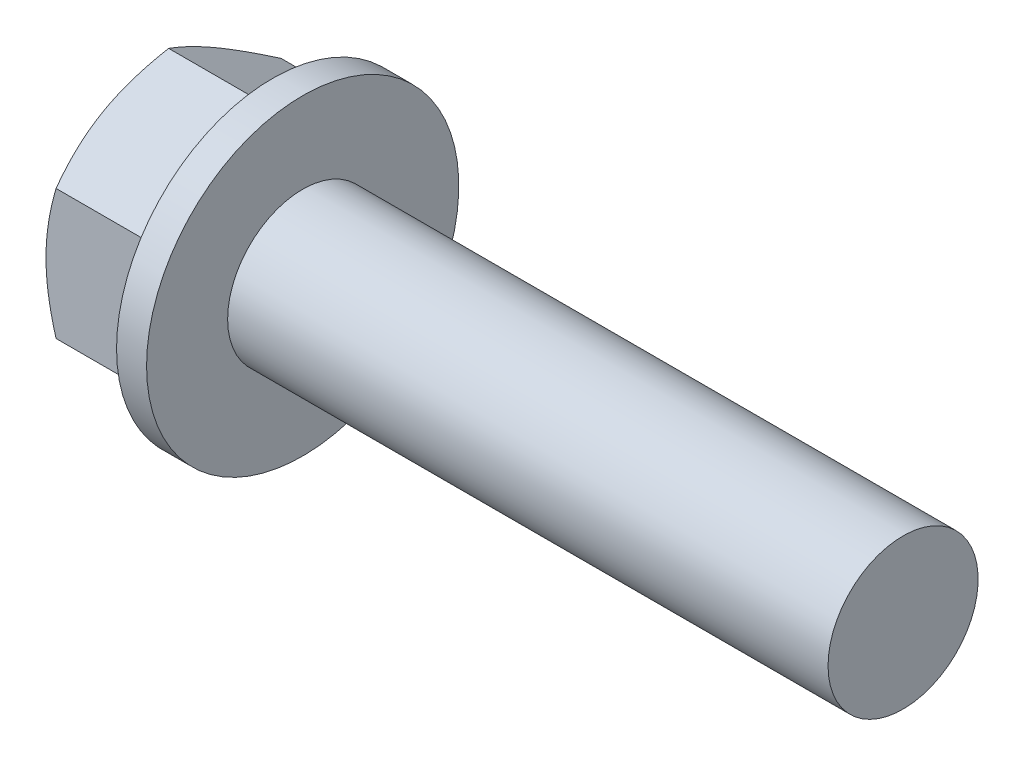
from build123d import *

# Parameters (mm, degrees)
SKETCH2_R     = 6.67004
HEX_DIE_DEPTH = 4.826
SKETCH4_R     = 4.1671875
INDENT_DEPTH  = 0.60325


with BuildPart() as part:
    # BodySke → Base-Revolve (revolve)
    with BuildSketch(Plane.XY, mode=Mode.PRIVATE) as base_revolve_sk:
        Polygon((6.096, 3.175), (6.096, 6.604), (4.826, 6.604), (4.826, 5.499422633), (0.42546248, 5.499422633), (0, 4.7625), (0, 0), (31.496, 0), (31.496, 3.175), align=None)
    revolve(base_revolve_sk.sketch.rotate(Axis((-25.4, 0, 0), (1, 0, 0)), 90), axis=Axis((-25.4, 0, 0), (1, 0, 0)))

    # Sketch2 → Hex-Die (cut)
    with BuildSketch(Plane(origin=(0, 0, 0), x_dir=(0, 0, -1), z_dir=(1, 0, 0))):
        Circle(SKETCH2_R)
        Polygon((-4.7625, 2.749630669), (0, 5.499261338), (4.7625, 2.749630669), (4.7625, -2.749630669), (0, -5.499261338), (-4.7625, -2.749630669), align=None, mode=Mode.SUBTRACT)
    extrude(amount=HEX_DIE_DEPTH, mode=Mode.SUBTRACT)

    # Sketch4 → Indent (cut)
    with BuildSketch(Plane(origin=(0, 0, 0), x_dir=(0, 0, -1), z_dir=(1, 0, 0))):
        with Locations(Location((0, 0, 0), (0, 0, 180))):
            Circle(SKETCH4_R)
    extrude(amount=INDENT_DEPTH, mode=Mode.SUBTRACT)


solid = part.part
